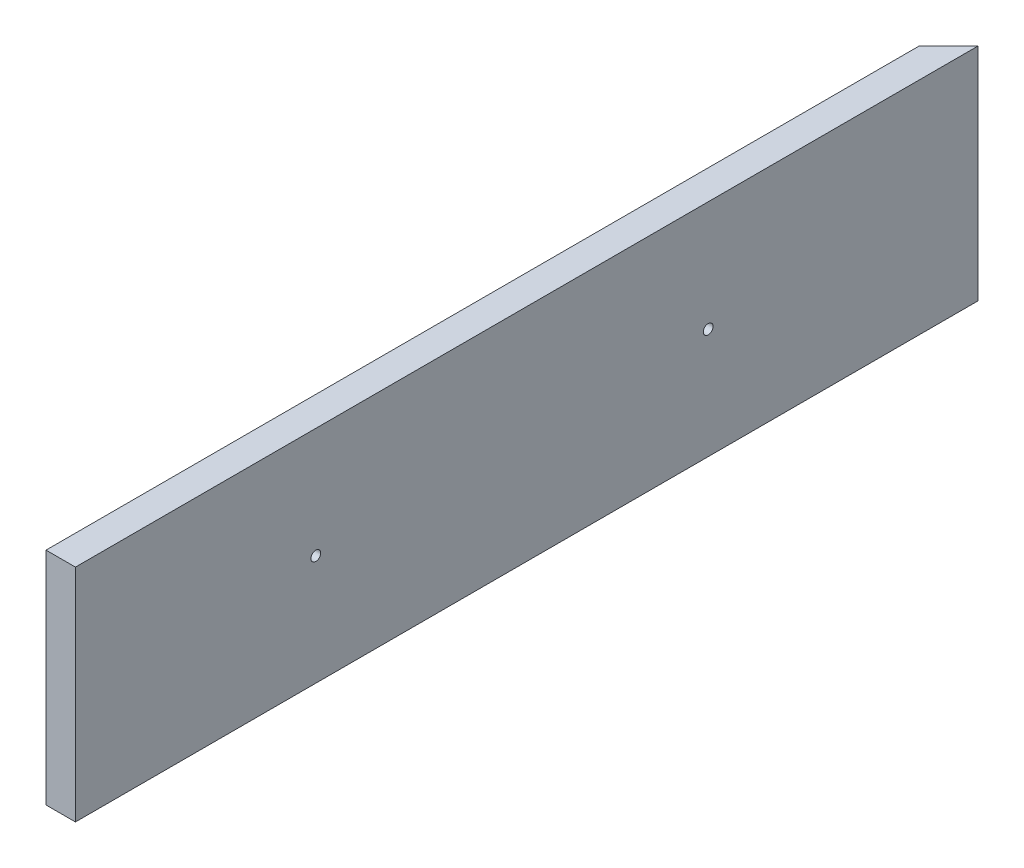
ISO-10303-21;
HEADER;
FILE_DESCRIPTION(('STEP AP214'),'2;1');
FILE_NAME('part.step','',(''),(''),'','','');
FILE_SCHEMA(('AUTOMOTIVE_DESIGN { 1 0 10303 214 1 1 1 1 }'));
ENDSEC;
DATA;
#1=APPLICATION_CONTEXT('core data for automotive mechanical design processes');
#2=APPLICATION_PROTOCOL_DEFINITION('international standard','automotive_design',2000,#1);
#3=PRODUCT_CONTEXT('',#1,'mechanical');
#4=PRODUCT('Part','Part','',(#3));
#5=PRODUCT_RELATED_PRODUCT_CATEGORY('part','',(#4));
#6=PRODUCT_DEFINITION_FORMATION('','',#4);
#7=PRODUCT_DEFINITION_CONTEXT('part definition',#1,'design');
#8=PRODUCT_DEFINITION('design','',#6,#7);
#9=PRODUCT_DEFINITION_SHAPE('','',#8);
#10=(LENGTH_UNIT() NAMED_UNIT(*) SI_UNIT(.MILLI.,.METRE.));
#11=(NAMED_UNIT(*) PLANE_ANGLE_UNIT() SI_UNIT($,.RADIAN.));
#12=(NAMED_UNIT(*) SI_UNIT($,.STERADIAN.) SOLID_ANGLE_UNIT());
#13=UNCERTAINTY_MEASURE_WITH_UNIT(LENGTH_MEASURE(1.E-05),#10,'distance_accuracy_value','');
#14=(GEOMETRIC_REPRESENTATION_CONTEXT(3) GLOBAL_UNCERTAINTY_ASSIGNED_CONTEXT((#13)) GLOBAL_UNIT_ASSIGNED_CONTEXT((#10,
#11,#12)) REPRESENTATION_CONTEXT('',''));
#15=CARTESIAN_POINT('',(0.,0.,0.));
#16=DIRECTION('',(0.,0.,1.));
#17=DIRECTION('',(1.,0.,0.));
#18=AXIS2_PLACEMENT_3D('',#15,#16,#17);
#19=CARTESIAN_POINT('',(0.,285.75,0.));
#20=DIRECTION('',(1.,0.,0.));
#21=DIRECTION('',(0.,0.,-1.));
#22=AXIS2_PLACEMENT_3D('',#19,#20,#21);
#23=PLANE('',#22);
#24=CARTESIAN_POINT('',(0.,142.875,-819.15));
#25=DIRECTION('',(-1.,0.,0.));
#26=DIRECTION('',(0.,0.,1.));
#27=AXIS2_PLACEMENT_3D('',#24,#25,#26);
#28=CIRCLE('',#27,6.34999999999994);
#29=CARTESIAN_POINT('',(0.,142.875,-812.8));
#30=VERTEX_POINT('',#29);
#31=EDGE_CURVE('E122',#30,#30,#28,.T.);
#32=ORIENTED_EDGE('',*,*,#31,.F.);
#33=EDGE_LOOP('',(#32));
#34=FACE_BOUND('',#33,.T.);
#35=CARTESIAN_POINT('',(0.,142.875,-311.15));
#36=DIRECTION('',(-1.,0.,0.));
#37=DIRECTION('',(0.,0.,1.));
#38=AXIS2_PLACEMENT_3D('',#35,#36,#37);
#39=CIRCLE('',#38,6.34999999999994);
#40=CARTESIAN_POINT('',(0.,142.875,-304.8));
#41=VERTEX_POINT('',#40);
#42=EDGE_CURVE('E119',#41,#41,#39,.T.);
#43=ORIENTED_EDGE('',*,*,#42,.F.);
#44=EDGE_LOOP('',(#43));
#45=FACE_BOUND('',#44,.T.);
#46=DIRECTION('',(0.,0.,1.));
#47=VECTOR('',#46,1.);
#48=CARTESIAN_POINT('',(0.,0.,0.));
#49=LINE('',#48,#47);
#50=CARTESIAN_POINT('',(0.,0.,-1130.3));
#51=VERTEX_POINT('',#50);
#52=CARTESIAN_POINT('',(0.,0.,0.));
#53=VERTEX_POINT('',#52);
#54=EDGE_CURVE('E102',#51,#53,#49,.T.);
#55=ORIENTED_EDGE('',*,*,#54,.T.);
#56=DIRECTION('',(0.,-1.,0.));
#57=VECTOR('',#56,1.);
#58=CARTESIAN_POINT('',(0.,285.75,0.));
#59=LINE('',#58,#57);
#60=CARTESIAN_POINT('',(0.,285.75,0.));
#61=VERTEX_POINT('',#60);
#62=EDGE_CURVE('E11',#61,#53,#59,.T.);
#63=ORIENTED_EDGE('',*,*,#62,.F.);
#64=DIRECTION('',(0.,0.,1.));
#65=VECTOR('',#64,1.);
#66=CARTESIAN_POINT('',(0.,285.75,0.));
#67=LINE('',#66,#65);
#68=CARTESIAN_POINT('',(0.,285.75,-1130.3));
#69=VERTEX_POINT('',#68);
#70=EDGE_CURVE('E89',#69,#61,#67,.T.);
#71=ORIENTED_EDGE('',*,*,#70,.F.);
#72=DIRECTION('',(0.,-1.,0.));
#73=VECTOR('',#72,1.);
#74=CARTESIAN_POINT('',(0.,285.75,-1130.3));
#75=LINE('',#74,#73);
#76=EDGE_CURVE('E98',#69,#51,#75,.T.);
#77=ORIENTED_EDGE('',*,*,#76,.T.);
#78=EDGE_LOOP('',(#55,#63,#71,#77));
#79=FACE_BOUND('',#78,.T.);
#80=ADVANCED_FACE('F39',(#34,#45,#79),#23,.F.);
#81=CARTESIAN_POINT('',(0.,285.75,0.));
#82=DIRECTION('',(0.,0.,-1.));
#83=DIRECTION('',(-1.,0.,0.));
#84=AXIS2_PLACEMENT_3D('',#81,#82,#83);
#85=PLANE('',#84);
#86=DIRECTION('',(1.,0.,0.));
#87=VECTOR('',#86,1.);
#88=CARTESIAN_POINT('',(0.,0.,0.));
#89=LINE('',#88,#87);
#90=CARTESIAN_POINT('',(38.1,0.,0.));
#91=VERTEX_POINT('',#90);
#92=EDGE_CURVE('E94',#53,#91,#89,.T.);
#93=ORIENTED_EDGE('',*,*,#92,.T.);
#94=DIRECTION('',(0.,-1.,0.));
#95=VECTOR('',#94,1.);
#96=CARTESIAN_POINT('',(38.1,285.75,0.));
#97=LINE('',#96,#95);
#98=CARTESIAN_POINT('',(38.1,285.75,0.));
#99=VERTEX_POINT('',#98);
#100=EDGE_CURVE('E47',#99,#91,#97,.T.);
#101=ORIENTED_EDGE('',*,*,#100,.F.);
#102=DIRECTION('',(1.,0.,0.));
#103=VECTOR('',#102,1.);
#104=CARTESIAN_POINT('',(0.,285.75,0.));
#105=LINE('',#104,#103);
#106=EDGE_CURVE('E84',#61,#99,#105,.T.);
#107=ORIENTED_EDGE('',*,*,#106,.F.);
#108=ORIENTED_EDGE('',*,*,#62,.T.);
#109=EDGE_LOOP('',(#93,#101,#107,#108));
#110=FACE_BOUND('',#109,.T.);
#111=ADVANCED_FACE('F93',(#110),#85,.F.);
#112=CARTESIAN_POINT('',(38.1,285.75,-1168.4));
#113=DIRECTION('',(-1.,0.,0.));
#114=DIRECTION('',(0.,0.,1.));
#115=AXIS2_PLACEMENT_3D('',#112,#113,#114);
#116=PLANE('',#115);
#117=CARTESIAN_POINT('',(38.1,142.875,-819.15));
#118=DIRECTION('',(-1.,0.,0.));
#119=DIRECTION('',(0.,0.,1.));
#120=AXIS2_PLACEMENT_3D('',#117,#118,#119);
#121=CIRCLE('',#120,6.34999999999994);
#122=CARTESIAN_POINT('',(38.1,142.875,-812.8));
#123=VERTEX_POINT('',#122);
#124=EDGE_CURVE('E105',#123,#123,#121,.T.);
#125=ORIENTED_EDGE('',*,*,#124,.T.);
#126=EDGE_LOOP('',(#125));
#127=FACE_BOUND('',#126,.T.);
#128=CARTESIAN_POINT('',(38.1,142.875,-311.15));
#129=DIRECTION('',(-1.,0.,0.));
#130=DIRECTION('',(0.,0.,1.));
#131=AXIS2_PLACEMENT_3D('',#128,#129,#130);
#132=CIRCLE('',#131,6.34999999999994);
#133=CARTESIAN_POINT('',(38.1,142.875,-304.8));
#134=VERTEX_POINT('',#133);
#135=EDGE_CURVE('E116',#134,#134,#132,.T.);
#136=ORIENTED_EDGE('',*,*,#135,.T.);
#137=EDGE_LOOP('',(#136));
#138=FACE_BOUND('',#137,.T.);
#139=DIRECTION('',(0.,0.,-1.));
#140=VECTOR('',#139,1.);
#141=CARTESIAN_POINT('',(38.1,0.,-1168.4));
#142=LINE('',#141,#140);
#143=CARTESIAN_POINT('',(38.1,0.,-1168.4));
#144=VERTEX_POINT('',#143);
#145=EDGE_CURVE('E71',#91,#144,#142,.T.);
#146=ORIENTED_EDGE('',*,*,#145,.T.);
#147=DIRECTION('',(0.,-1.,0.));
#148=VECTOR('',#147,1.);
#149=CARTESIAN_POINT('',(38.1,285.75,-1168.4));
#150=LINE('',#149,#148);
#151=CARTESIAN_POINT('',(38.1,285.75,-1168.4));
#152=VERTEX_POINT('',#151);
#153=EDGE_CURVE('E95',#152,#144,#150,.T.);
#154=ORIENTED_EDGE('',*,*,#153,.F.);
#155=DIRECTION('',(0.,0.,-1.));
#156=VECTOR('',#155,1.);
#157=CARTESIAN_POINT('',(38.1,285.75,0.));
#158=LINE('',#157,#156);
#159=EDGE_CURVE('E87',#99,#152,#158,.T.);
#160=ORIENTED_EDGE('',*,*,#159,.F.);
#161=ORIENTED_EDGE('',*,*,#100,.T.);
#162=EDGE_LOOP('',(#146,#154,#160,#161));
#163=FACE_BOUND('',#162,.T.);
#164=ADVANCED_FACE('F96',(#127,#138,#163),#116,.F.);
#165=CARTESIAN_POINT('',(0.,285.75,-1130.3));
#166=DIRECTION('',(0.70710678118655,0.,0.707106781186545));
#167=DIRECTION('',(0.707106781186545,0.,-0.70710678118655));
#168=AXIS2_PLACEMENT_3D('',#165,#166,#167);
#169=PLANE('',#168);
#170=DIRECTION('',(-0.707106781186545,0.,0.70710678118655));
#171=VECTOR('',#170,1.);
#172=CARTESIAN_POINT('',(0.,0.,-1130.3));
#173=LINE('',#172,#171);
#174=EDGE_CURVE('E77',#144,#51,#173,.T.);
#175=ORIENTED_EDGE('',*,*,#174,.T.);
#176=ORIENTED_EDGE('',*,*,#76,.F.);
#177=DIRECTION('',(-0.707106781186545,0.,0.70710678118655));
#178=VECTOR('',#177,1.);
#179=CARTESIAN_POINT('',(0.,285.75,-1130.3));
#180=LINE('',#179,#178);
#181=EDGE_CURVE('E55',#152,#69,#180,.T.);
#182=ORIENTED_EDGE('',*,*,#181,.F.);
#183=ORIENTED_EDGE('',*,*,#153,.T.);
#184=EDGE_LOOP('',(#175,#176,#182,#183));
#185=FACE_BOUND('',#184,.T.);
#186=ADVANCED_FACE('F110',(#185),#169,.F.);
#187=CARTESIAN_POINT('',(0.,285.75,0.));
#188=DIRECTION('',(0.,-1.,0.));
#189=DIRECTION('',(0.,0.,-1.));
#190=AXIS2_PLACEMENT_3D('',#187,#188,#189);
#191=PLANE('',#190);
#192=ORIENTED_EDGE('',*,*,#70,.T.);
#193=ORIENTED_EDGE('',*,*,#106,.T.);
#194=ORIENTED_EDGE('',*,*,#159,.T.);
#195=ORIENTED_EDGE('',*,*,#181,.T.);
#196=EDGE_LOOP('',(#192,#193,#194,#195));
#197=FACE_BOUND('',#196,.T.);
#198=ADVANCED_FACE('F85',(#197),#191,.F.);
#199=CARTESIAN_POINT('',(0.,0.,0.));
#200=DIRECTION('',(0.,-1.,0.));
#201=DIRECTION('',(0.,0.,-1.));
#202=AXIS2_PLACEMENT_3D('',#199,#200,#201);
#203=PLANE('',#202);
#204=ORIENTED_EDGE('',*,*,#54,.F.);
#205=ORIENTED_EDGE('',*,*,#174,.F.);
#206=ORIENTED_EDGE('',*,*,#145,.F.);
#207=ORIENTED_EDGE('',*,*,#92,.F.);
#208=EDGE_LOOP('',(#204,#205,#206,#207));
#209=FACE_BOUND('',#208,.T.);
#210=ADVANCED_FACE('F113',(#209),#203,.T.);
#211=CARTESIAN_POINT('',(38.1,142.875,-311.15));
#212=DIRECTION('',(-1.,0.,0.));
#213=DIRECTION('',(0.,0.,1.));
#214=AXIS2_PLACEMENT_3D('',#211,#212,#213);
#215=CYLINDRICAL_SURFACE('',#214,6.34999999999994);
#216=CARTESIAN_POINT('',(38.1,142.875,-304.8));
#217=CARTESIAN_POINT('',(37.703125,142.875,-304.8));
#218=CARTESIAN_POINT('',(37.30625,142.875,-304.8));
#219=CARTESIAN_POINT('',(36.5125,142.875,-304.8));
#220=CARTESIAN_POINT('',(36.115625,142.875,-304.8));
#221=CARTESIAN_POINT('',(35.321875,142.875,-304.8));
#222=CARTESIAN_POINT('',(34.925,142.875,-304.8));
#223=CARTESIAN_POINT('',(34.13125,142.875,-304.8));
#224=CARTESIAN_POINT('',(33.734375,142.875,-304.8));
#225=CARTESIAN_POINT('',(32.940625,142.875,-304.8));
#226=CARTESIAN_POINT('',(32.54375,142.875,-304.8));
#227=CARTESIAN_POINT('',(31.75,142.875,-304.8));
#228=CARTESIAN_POINT('',(31.353125,142.875,-304.8));
#229=CARTESIAN_POINT('',(30.559375,142.875,-304.8));
#230=CARTESIAN_POINT('',(30.1625,142.875,-304.8));
#231=CARTESIAN_POINT('',(29.36875,142.875,-304.8));
#232=CARTESIAN_POINT('',(28.971875,142.875,-304.8));
#233=CARTESIAN_POINT('',(28.178125,142.875,-304.8));
#234=CARTESIAN_POINT('',(27.78125,142.875,-304.8));
#235=CARTESIAN_POINT('',(26.9875,142.875,-304.8));
#236=CARTESIAN_POINT('',(26.590625,142.875,-304.8));
#237=CARTESIAN_POINT('',(25.796875,142.875,-304.8));
#238=CARTESIAN_POINT('',(25.4,142.875,-304.8));
#239=CARTESIAN_POINT('',(24.60625,142.875,-304.8));
#240=CARTESIAN_POINT('',(24.209375,142.875,-304.8));
#241=CARTESIAN_POINT('',(23.415625,142.875,-304.8));
#242=CARTESIAN_POINT('',(23.01875,142.875,-304.8));
#243=CARTESIAN_POINT('',(22.225,142.875,-304.8));
#244=CARTESIAN_POINT('',(21.828125,142.875,-304.8));
#245=CARTESIAN_POINT('',(21.034375,142.875,-304.8));
#246=CARTESIAN_POINT('',(20.6375,142.875,-304.8));
#247=CARTESIAN_POINT('',(19.84375,142.875,-304.8));
#248=CARTESIAN_POINT('',(19.446875,142.875,-304.8));
#249=CARTESIAN_POINT('',(18.653125,142.875,-304.8));
#250=CARTESIAN_POINT('',(18.25625,142.875,-304.8));
#251=CARTESIAN_POINT('',(17.4625,142.875,-304.8));
#252=CARTESIAN_POINT('',(17.065625,142.875,-304.8));
#253=CARTESIAN_POINT('',(16.271875,142.875,-304.8));
#254=CARTESIAN_POINT('',(15.875,142.875,-304.8));
#255=CARTESIAN_POINT('',(15.08125,142.875,-304.8));
#256=CARTESIAN_POINT('',(14.684375,142.875,-304.8));
#257=CARTESIAN_POINT('',(13.890625,142.875,-304.8));
#258=CARTESIAN_POINT('',(13.49375,142.875,-304.8));
#259=CARTESIAN_POINT('',(12.7,142.875,-304.8));
#260=CARTESIAN_POINT('',(12.303125,142.875,-304.8));
#261=CARTESIAN_POINT('',(11.509375,142.875,-304.8));
#262=CARTESIAN_POINT('',(11.1125,142.875,-304.8));
#263=CARTESIAN_POINT('',(10.31875,142.875,-304.8));
#264=CARTESIAN_POINT('',(9.921875,142.875,-304.8));
#265=CARTESIAN_POINT('',(9.128125,142.875,-304.8));
#266=CARTESIAN_POINT('',(8.73125,142.875,-304.8));
#267=CARTESIAN_POINT('',(7.9375,142.875,-304.8));
#268=CARTESIAN_POINT('',(7.540625,142.875,-304.8));
#269=CARTESIAN_POINT('',(6.746875,142.875,-304.8));
#270=CARTESIAN_POINT('',(6.35,142.875,-304.8));
#271=CARTESIAN_POINT('',(5.55625,142.875,-304.8));
#272=CARTESIAN_POINT('',(5.159375,142.875,-304.8));
#273=CARTESIAN_POINT('',(4.365625,142.875,-304.8));
#274=CARTESIAN_POINT('',(3.96875,142.875,-304.8));
#275=CARTESIAN_POINT('',(3.175,142.875,-304.8));
#276=CARTESIAN_POINT('',(2.778125,142.875,-304.8));
#277=CARTESIAN_POINT('',(1.984375,142.875,-304.8));
#278=CARTESIAN_POINT('',(1.5875,142.875,-304.8));
#279=CARTESIAN_POINT('',(0.79375,142.875,-304.8));
#280=CARTESIAN_POINT('',(0.396875,142.875,-304.8));
#281=CARTESIAN_POINT('',(0.,142.875,-304.8));
#282=B_SPLINE_CURVE_WITH_KNOTS('',3,(#216,#217,#218,#219,#220,#221,#222,#223,#224,#225,#226,
#227,#228,#229,#230,#231,#232,#233,#234,#235,#236,#237,#238,#239,#240,#241,#242,#243,#244,#245,
#246,#247,#248,#249,#250,#251,#252,#253,#254,#255,#256,#257,#258,#259,#260,#261,#262,#263,#264,
#265,#266,#267,#268,#269,#270,#271,#272,#273,#274,#275,#276,#277,#278,#279,#280,#281),
.UNSPECIFIED.,.F.,.F.,(4,2,2,2,2,2,2,2,2,2,2,2,2,2,2,2,2,2,2,2,2,2,2,2,2,2,2,2,2,2,2,2,4),(0.,
1.190625,2.38125,3.571875,4.7625,5.953125,7.14375,8.334375,9.52500000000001,10.715625,11.90625,
13.096875,14.2875,15.478125,16.66875,17.859375,19.05,20.240625,21.43125,22.621875,23.8125,
25.003125,26.19375,27.384375,28.575,29.765625,30.95625,32.146875,33.3375,34.528125,35.71875,
36.909375,38.1),.UNSPECIFIED.);
#283=EDGE_CURVE('BSEAM133',#134,#41,#282,.T.);
#284=ORIENTED_EDGE('',*,*,#135,.F.);
#285=ORIENTED_EDGE('',*,*,#42,.T.);
#286=ORIENTED_EDGE('',*,*,#283,.T.);
#287=ORIENTED_EDGE('',*,*,#283,.F.);
#288=EDGE_LOOP('',(#284,#286,#285,#287));
#289=FACE_BOUND('',#288,.T.);
#290=ADVANCED_FACE('F133',(#289),#215,.F.);
#291=CARTESIAN_POINT('',(38.1,142.875,-819.15));
#292=DIRECTION('',(-1.,0.,0.));
#293=DIRECTION('',(0.,0.,1.));
#294=AXIS2_PLACEMENT_3D('',#291,#292,#293);
#295=CYLINDRICAL_SURFACE('',#294,6.34999999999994);
#296=CARTESIAN_POINT('',(38.1,142.875,-812.8));
#297=CARTESIAN_POINT('',(37.703125,142.875,-812.8));
#298=CARTESIAN_POINT('',(37.30625,142.875,-812.8));
#299=CARTESIAN_POINT('',(36.5125,142.875,-812.8));
#300=CARTESIAN_POINT('',(36.115625,142.875,-812.8));
#301=CARTESIAN_POINT('',(35.321875,142.875,-812.8));
#302=CARTESIAN_POINT('',(34.925,142.875,-812.8));
#303=CARTESIAN_POINT('',(34.13125,142.875,-812.8));
#304=CARTESIAN_POINT('',(33.734375,142.875,-812.8));
#305=CARTESIAN_POINT('',(32.940625,142.875,-812.8));
#306=CARTESIAN_POINT('',(32.54375,142.875,-812.8));
#307=CARTESIAN_POINT('',(31.75,142.875,-812.8));
#308=CARTESIAN_POINT('',(31.353125,142.875,-812.8));
#309=CARTESIAN_POINT('',(30.559375,142.875,-812.8));
#310=CARTESIAN_POINT('',(30.1625,142.875,-812.8));
#311=CARTESIAN_POINT('',(29.36875,142.875,-812.8));
#312=CARTESIAN_POINT('',(28.971875,142.875,-812.8));
#313=CARTESIAN_POINT('',(28.178125,142.875,-812.8));
#314=CARTESIAN_POINT('',(27.78125,142.875,-812.8));
#315=CARTESIAN_POINT('',(26.9875,142.875,-812.8));
#316=CARTESIAN_POINT('',(26.590625,142.875,-812.8));
#317=CARTESIAN_POINT('',(25.796875,142.875,-812.8));
#318=CARTESIAN_POINT('',(25.4,142.875,-812.8));
#319=CARTESIAN_POINT('',(24.60625,142.875,-812.8));
#320=CARTESIAN_POINT('',(24.209375,142.875,-812.8));
#321=CARTESIAN_POINT('',(23.415625,142.875,-812.8));
#322=CARTESIAN_POINT('',(23.01875,142.875,-812.8));
#323=CARTESIAN_POINT('',(22.225,142.875,-812.8));
#324=CARTESIAN_POINT('',(21.828125,142.875,-812.8));
#325=CARTESIAN_POINT('',(21.034375,142.875,-812.8));
#326=CARTESIAN_POINT('',(20.6375,142.875,-812.8));
#327=CARTESIAN_POINT('',(19.84375,142.875,-812.8));
#328=CARTESIAN_POINT('',(19.446875,142.875,-812.8));
#329=CARTESIAN_POINT('',(18.653125,142.875,-812.8));
#330=CARTESIAN_POINT('',(18.25625,142.875,-812.8));
#331=CARTESIAN_POINT('',(17.4625,142.875,-812.8));
#332=CARTESIAN_POINT('',(17.065625,142.875,-812.8));
#333=CARTESIAN_POINT('',(16.271875,142.875,-812.8));
#334=CARTESIAN_POINT('',(15.875,142.875,-812.8));
#335=CARTESIAN_POINT('',(15.08125,142.875,-812.8));
#336=CARTESIAN_POINT('',(14.684375,142.875,-812.8));
#337=CARTESIAN_POINT('',(13.890625,142.875,-812.8));
#338=CARTESIAN_POINT('',(13.49375,142.875,-812.8));
#339=CARTESIAN_POINT('',(12.7,142.875,-812.8));
#340=CARTESIAN_POINT('',(12.303125,142.875,-812.8));
#341=CARTESIAN_POINT('',(11.509375,142.875,-812.8));
#342=CARTESIAN_POINT('',(11.1125,142.875,-812.8));
#343=CARTESIAN_POINT('',(10.31875,142.875,-812.8));
#344=CARTESIAN_POINT('',(9.921875,142.875,-812.8));
#345=CARTESIAN_POINT('',(9.128125,142.875,-812.8));
#346=CARTESIAN_POINT('',(8.73125,142.875,-812.8));
#347=CARTESIAN_POINT('',(7.9375,142.875,-812.8));
#348=CARTESIAN_POINT('',(7.540625,142.875,-812.8));
#349=CARTESIAN_POINT('',(6.746875,142.875,-812.8));
#350=CARTESIAN_POINT('',(6.35,142.875,-812.8));
#351=CARTESIAN_POINT('',(5.55625,142.875,-812.8));
#352=CARTESIAN_POINT('',(5.159375,142.875,-812.8));
#353=CARTESIAN_POINT('',(4.365625,142.875,-812.8));
#354=CARTESIAN_POINT('',(3.96875,142.875,-812.8));
#355=CARTESIAN_POINT('',(3.175,142.875,-812.8));
#356=CARTESIAN_POINT('',(2.778125,142.875,-812.8));
#357=CARTESIAN_POINT('',(1.984375,142.875,-812.8));
#358=CARTESIAN_POINT('',(1.5875,142.875,-812.8));
#359=CARTESIAN_POINT('',(0.79375,142.875,-812.8));
#360=CARTESIAN_POINT('',(0.396875,142.875,-812.8));
#361=CARTESIAN_POINT('',(0.,142.875,-812.8));
#362=B_SPLINE_CURVE_WITH_KNOTS('',3,(#296,#297,#298,#299,#300,#301,#302,#303,#304,#305,#306,
#307,#308,#309,#310,#311,#312,#313,#314,#315,#316,#317,#318,#319,#320,#321,#322,#323,#324,#325,
#326,#327,#328,#329,#330,#331,#332,#333,#334,#335,#336,#337,#338,#339,#340,#341,#342,#343,#344,
#345,#346,#347,#348,#349,#350,#351,#352,#353,#354,#355,#356,#357,#358,#359,#360,#361),
.UNSPECIFIED.,.F.,.F.,(4,2,2,2,2,2,2,2,2,2,2,2,2,2,2,2,2,2,2,2,2,2,2,2,2,2,2,2,2,2,2,2,4),(0.,
1.190625,2.38125,3.571875,4.7625,5.953125,7.14375,8.334375,9.52500000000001,10.715625,11.90625,
13.096875,14.2875,15.478125,16.66875,17.859375,19.05,20.240625,21.43125,22.621875,23.8125,
25.003125,26.19375,27.384375,28.575,29.765625,30.95625,32.146875,33.3375,34.528125,35.71875,
36.909375,38.1),.UNSPECIFIED.);
#363=EDGE_CURVE('BSEAM130',#123,#30,#362,.T.);
#364=ORIENTED_EDGE('',*,*,#124,.F.);
#365=ORIENTED_EDGE('',*,*,#31,.T.);
#366=ORIENTED_EDGE('',*,*,#363,.T.);
#367=ORIENTED_EDGE('',*,*,#363,.F.);
#368=EDGE_LOOP('',(#364,#366,#365,#367));
#369=FACE_BOUND('',#368,.T.);
#370=ADVANCED_FACE('F130',(#369),#295,.F.);
#371=CLOSED_SHELL('',(#80,#111,#164,#186,#198,#210,#290,#370));
#372=MANIFOLD_SOLID_BREP('B2',#371);
#373=ADVANCED_BREP_SHAPE_REPRESENTATION('',(#18,#372),#14);
#374=SHAPE_DEFINITION_REPRESENTATION(#9,#373);
ENDSEC;
END-ISO-10303-21;
